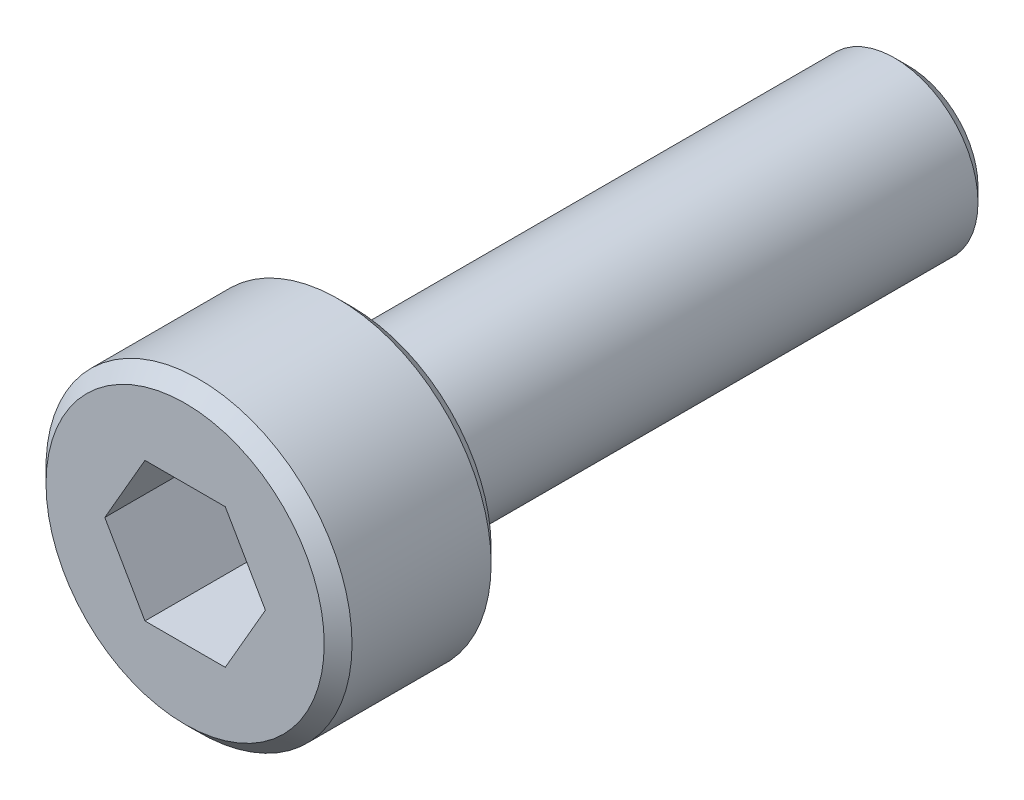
ISO-10303-21;
HEADER;
FILE_DESCRIPTION(('STEP AP214'),'2;1');
FILE_NAME('part.step','',(''),(''),'','','');
FILE_SCHEMA(('AUTOMOTIVE_DESIGN { 1 0 10303 214 1 1 1 1 }'));
ENDSEC;
DATA;
#1=APPLICATION_CONTEXT('core data for automotive mechanical design processes');
#2=APPLICATION_PROTOCOL_DEFINITION('international standard','automotive_design',2000,#1);
#3=PRODUCT_CONTEXT('',#1,'mechanical');
#4=PRODUCT('Part','Part','',(#3));
#5=PRODUCT_RELATED_PRODUCT_CATEGORY('part','',(#4));
#6=PRODUCT_DEFINITION_FORMATION('','',#4);
#7=PRODUCT_DEFINITION_CONTEXT('part definition',#1,'design');
#8=PRODUCT_DEFINITION('design','',#6,#7);
#9=PRODUCT_DEFINITION_SHAPE('','',#8);
#10=(LENGTH_UNIT() NAMED_UNIT(*) SI_UNIT(.MILLI.,.METRE.));
#11=(NAMED_UNIT(*) PLANE_ANGLE_UNIT() SI_UNIT($,.RADIAN.));
#12=(NAMED_UNIT(*) SI_UNIT($,.STERADIAN.) SOLID_ANGLE_UNIT());
#13=UNCERTAINTY_MEASURE_WITH_UNIT(LENGTH_MEASURE(1.E-05),#10,'distance_accuracy_value','');
#14=(GEOMETRIC_REPRESENTATION_CONTEXT(3) GLOBAL_UNCERTAINTY_ASSIGNED_CONTEXT((#13)) GLOBAL_UNIT_ASSIGNED_CONTEXT((#10,
#11,#12)) REPRESENTATION_CONTEXT('',''));
#15=CARTESIAN_POINT('',(0.,0.,0.));
#16=DIRECTION('',(0.,0.,1.));
#17=DIRECTION('',(1.,0.,0.));
#18=AXIS2_PLACEMENT_3D('',#15,#16,#17);
#19=CARTESIAN_POINT('',(0.,0.,10.));
#20=DIRECTION('',(0.,0.,-1.));
#21=DIRECTION('',(-1.,0.,0.));
#22=AXIS2_PLACEMENT_3D('',#19,#20,#21);
#23=CYLINDRICAL_SURFACE('',#22,1.5);
#24=CARTESIAN_POINT('',(0.,0.,0.25));
#25=DIRECTION('',(0.,0.,1.));
#26=DIRECTION('',(1.,0.,0.));
#27=AXIS2_PLACEMENT_3D('',#24,#25,#26);
#28=CIRCLE('',#27,1.5);
#29=CARTESIAN_POINT('',(1.5,0.,0.25));
#30=VERTEX_POINT('',#29);
#31=EDGE_CURVE('E189',#30,#30,#28,.T.);
#32=ORIENTED_EDGE('',*,*,#31,.T.);
#33=EDGE_LOOP('',(#32));
#34=FACE_BOUND('',#33,.T.);
#35=CARTESIAN_POINT('',(0.,0.,10.));
#36=DIRECTION('',(0.,0.,1.));
#37=DIRECTION('',(1.,0.,0.));
#38=AXIS2_PLACEMENT_3D('',#35,#36,#37);
#39=CIRCLE('',#38,1.5);
#40=CARTESIAN_POINT('',(1.5,0.,10.));
#41=VERTEX_POINT('',#40);
#42=EDGE_CURVE('E164',#41,#41,#39,.T.);
#43=ORIENTED_EDGE('',*,*,#42,.F.);
#44=EDGE_LOOP('',(#43));
#45=FACE_BOUND('',#44,.T.);
#46=ADVANCED_FACE('F47',(#34,#45),#23,.T.);
#47=CARTESIAN_POINT('',(0.,0.,0.));
#48=DIRECTION('',(0.,0.,1.));
#49=DIRECTION('',(1.,0.,0.));
#50=AXIS2_PLACEMENT_3D('',#47,#48,#49);
#51=PLANE('',#50);
#52=CARTESIAN_POINT('',(0.,0.,0.));
#53=DIRECTION('',(0.,0.,1.));
#54=DIRECTION('',(1.,0.,0.));
#55=AXIS2_PLACEMENT_3D('',#52,#53,#54);
#56=CIRCLE('',#55,1.25);
#57=CARTESIAN_POINT('',(1.25,0.,0.));
#58=VERTEX_POINT('',#57);
#59=EDGE_CURVE('E56',#58,#58,#56,.F.);
#60=ORIENTED_EDGE('',*,*,#59,.T.);
#61=EDGE_LOOP('',(#60));
#62=FACE_BOUND('',#61,.T.);
#63=ADVANCED_FACE('F197',(#62),#51,.F.);
#64=CARTESIAN_POINT('',(0.,0.,13.));
#65=DIRECTION('',(0.,0.,-1.));
#66=DIRECTION('',(-1.,0.,0.));
#67=AXIS2_PLACEMENT_3D('',#64,#65,#66);
#68=CYLINDRICAL_SURFACE('',#67,2.75);
#69=CARTESIAN_POINT('',(0.,0.,10.25));
#70=DIRECTION('',(0.,0.,1.));
#71=DIRECTION('',(1.,0.,0.));
#72=AXIS2_PLACEMENT_3D('',#69,#70,#71);
#73=CIRCLE('',#72,2.75);
#74=CARTESIAN_POINT('',(2.75,0.,10.25));
#75=VERTEX_POINT('',#74);
#76=EDGE_CURVE('E185',#75,#75,#73,.T.);
#77=ORIENTED_EDGE('',*,*,#76,.T.);
#78=EDGE_LOOP('',(#77));
#79=FACE_BOUND('',#78,.T.);
#80=CARTESIAN_POINT('',(0.,0.,12.75));
#81=DIRECTION('',(0.,0.,1.));
#82=DIRECTION('',(1.,0.,0.));
#83=AXIS2_PLACEMENT_3D('',#80,#81,#82);
#84=CIRCLE('',#83,2.75);
#85=CARTESIAN_POINT('',(2.75,0.,12.75));
#86=VERTEX_POINT('',#85);
#87=EDGE_CURVE('E179',#86,#86,#84,.F.);
#88=ORIENTED_EDGE('',*,*,#87,.T.);
#89=EDGE_LOOP('',(#88));
#90=FACE_BOUND('',#89,.T.);
#91=ADVANCED_FACE('F225',(#79,#90),#68,.T.);
#92=CARTESIAN_POINT('',(0.,0.,13.));
#93=DIRECTION('',(0.,0.,1.));
#94=DIRECTION('',(1.,0.,0.));
#95=AXIS2_PLACEMENT_3D('',#92,#93,#94);
#96=PLANE('',#95);
#97=DIRECTION('',(0.5,0.866025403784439,0.));
#98=VECTOR('',#97,1.);
#99=CARTESIAN_POINT('',(0.721687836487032,-1.25,13.));
#100=LINE('',#99,#98);
#101=CARTESIAN_POINT('',(0.721687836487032,-1.25,13.));
#102=VERTEX_POINT('',#101);
#103=CARTESIAN_POINT('',(1.44337567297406,0.,13.));
#104=VERTEX_POINT('',#103);
#105=EDGE_CURVE('E66',#102,#104,#100,.T.);
#106=ORIENTED_EDGE('',*,*,#105,.F.);
#107=DIRECTION('',(1.,0.,0.));
#108=VECTOR('',#107,1.);
#109=CARTESIAN_POINT('',(-0.721687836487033,-1.25,13.));
#110=LINE('',#109,#108);
#111=CARTESIAN_POINT('',(-0.721687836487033,-1.25,13.));
#112=VERTEX_POINT('',#111);
#113=EDGE_CURVE('E157',#112,#102,#110,.T.);
#114=ORIENTED_EDGE('',*,*,#113,.F.);
#115=DIRECTION('',(0.5,-0.866025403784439,0.));
#116=VECTOR('',#115,1.);
#117=CARTESIAN_POINT('',(-1.44337567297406,0.,13.));
#118=LINE('',#117,#116);
#119=CARTESIAN_POINT('',(-1.44337567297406,0.,13.));
#120=VERTEX_POINT('',#119);
#121=EDGE_CURVE('E156',#120,#112,#118,.T.);
#122=ORIENTED_EDGE('',*,*,#121,.F.);
#123=DIRECTION('',(-0.5,-0.866025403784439,0.));
#124=VECTOR('',#123,1.);
#125=CARTESIAN_POINT('',(-0.721687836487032,1.25,13.));
#126=LINE('',#125,#124);
#127=CARTESIAN_POINT('',(-0.721687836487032,1.25,13.));
#128=VERTEX_POINT('',#127);
#129=EDGE_CURVE('E111',#128,#120,#126,.T.);
#130=ORIENTED_EDGE('',*,*,#129,.F.);
#131=DIRECTION('',(-1.,0.,0.));
#132=VECTOR('',#131,1.);
#133=CARTESIAN_POINT('',(0.721687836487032,1.25,13.));
#134=LINE('',#133,#132);
#135=CARTESIAN_POINT('',(0.721687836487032,1.25,13.));
#136=VERTEX_POINT('',#135);
#137=EDGE_CURVE('E147',#136,#128,#134,.T.);
#138=ORIENTED_EDGE('',*,*,#137,.F.);
#139=DIRECTION('',(-0.5,0.866025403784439,0.));
#140=VECTOR('',#139,1.);
#141=CARTESIAN_POINT('',(1.44337567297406,0.,13.));
#142=LINE('',#141,#140);
#143=EDGE_CURVE('E148',#104,#136,#142,.T.);
#144=ORIENTED_EDGE('',*,*,#143,.F.);
#145=EDGE_LOOP('',(#106,#114,#122,#130,#138,#144));
#146=FACE_BOUND('',#145,.T.);
#147=CARTESIAN_POINT('',(0.,0.,13.));
#148=DIRECTION('',(0.,0.,1.));
#149=DIRECTION('',(1.,0.,0.));
#150=AXIS2_PLACEMENT_3D('',#147,#148,#149);
#151=CIRCLE('',#150,2.5);
#152=CARTESIAN_POINT('',(2.5,0.,13.));
#153=VERTEX_POINT('',#152);
#154=EDGE_CURVE('E11',#153,#153,#151,.T.);
#155=ORIENTED_EDGE('',*,*,#154,.T.);
#156=EDGE_LOOP('',(#155));
#157=FACE_BOUND('',#156,.T.);
#158=ADVANCED_FACE('F215',(#146,#157),#96,.T.);
#159=CARTESIAN_POINT('',(0.,0.,10.));
#160=DIRECTION('',(0.,0.,1.));
#161=DIRECTION('',(1.,0.,0.));
#162=AXIS2_PLACEMENT_3D('',#159,#160,#161);
#163=PLANE('',#162);
#164=CARTESIAN_POINT('',(0.,0.,10.));
#165=DIRECTION('',(0.,0.,1.));
#166=DIRECTION('',(1.,0.,0.));
#167=AXIS2_PLACEMENT_3D('',#164,#165,#166);
#168=CIRCLE('',#167,2.5);
#169=CARTESIAN_POINT('',(2.5,0.,10.));
#170=VERTEX_POINT('',#169);
#171=EDGE_CURVE('E188',#170,#170,#168,.F.);
#172=ORIENTED_EDGE('',*,*,#171,.T.);
#173=EDGE_LOOP('',(#172));
#174=FACE_BOUND('',#173,.T.);
#175=ORIENTED_EDGE('',*,*,#42,.T.);
#176=EDGE_LOOP('',(#175));
#177=FACE_BOUND('',#176,.T.);
#178=ADVANCED_FACE('F209',(#174,#177),#163,.F.);
#179=CARTESIAN_POINT('',(0.,0.,10.25));
#180=DIRECTION('',(0.,0.,1.));
#181=DIRECTION('',(1.,0.,0.));
#182=AXIS2_PLACEMENT_3D('',#179,#180,#181);
#183=CONICAL_SURFACE('',#182,2.75,0.785398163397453);
#184=ORIENTED_EDGE('',*,*,#171,.F.);
#185=EDGE_LOOP('',(#184));
#186=FACE_BOUND('',#185,.T.);
#187=ORIENTED_EDGE('',*,*,#76,.F.);
#188=EDGE_LOOP('',(#187));
#189=FACE_BOUND('',#188,.T.);
#190=ADVANCED_FACE('F205',(#186,#189),#183,.T.);
#191=CARTESIAN_POINT('',(0.,0.,0.25));
#192=DIRECTION('',(0.,0.,1.));
#193=DIRECTION('',(1.,0.,0.));
#194=AXIS2_PLACEMENT_3D('',#191,#192,#193);
#195=CONICAL_SURFACE('',#194,1.5,0.785398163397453);
#196=ORIENTED_EDGE('',*,*,#59,.F.);
#197=EDGE_LOOP('',(#196));
#198=FACE_BOUND('',#197,.T.);
#199=ORIENTED_EDGE('',*,*,#31,.F.);
#200=EDGE_LOOP('',(#199));
#201=FACE_BOUND('',#200,.T.);
#202=ADVANCED_FACE('F200',(#198,#201),#195,.T.);
#203=CARTESIAN_POINT('',(0.,0.,13.));
#204=DIRECTION('',(0.,0.,-1.));
#205=DIRECTION('',(-1.,0.,0.));
#206=AXIS2_PLACEMENT_3D('',#203,#204,#205);
#207=CONICAL_SURFACE('',#206,2.5,0.785398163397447);
#208=ORIENTED_EDGE('',*,*,#87,.F.);
#209=EDGE_LOOP('',(#208));
#210=FACE_BOUND('',#209,.T.);
#211=ORIENTED_EDGE('',*,*,#154,.F.);
#212=EDGE_LOOP('',(#211));
#213=FACE_BOUND('',#212,.T.);
#214=ADVANCED_FACE('F55',(#210,#213),#207,.T.);
#215=CARTESIAN_POINT('',(0.721687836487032,-1.25,11.));
#216=DIRECTION('',(0.866025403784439,-0.5,0.));
#217=DIRECTION('',(0.5,0.866025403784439,0.));
#218=AXIS2_PLACEMENT_3D('',#215,#216,#217);
#219=PLANE('',#218);
#220=ORIENTED_EDGE('',*,*,#105,.T.);
#221=DIRECTION('',(0.,0.,1.));
#222=VECTOR('',#221,1.);
#223=CARTESIAN_POINT('',(1.44337567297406,0.,11.));
#224=LINE('',#223,#222);
#225=CARTESIAN_POINT('',(1.44337567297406,0.,11.));
#226=VERTEX_POINT('',#225);
#227=EDGE_CURVE('E96',#226,#104,#224,.T.);
#228=ORIENTED_EDGE('',*,*,#227,.F.);
#229=DIRECTION('',(0.5,0.866025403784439,0.));
#230=VECTOR('',#229,1.);
#231=CARTESIAN_POINT('',(0.721687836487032,-1.25,11.));
#232=LINE('',#231,#230);
#233=CARTESIAN_POINT('',(0.721687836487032,-1.25,11.));
#234=VERTEX_POINT('',#233);
#235=EDGE_CURVE('E165',#234,#226,#232,.T.);
#236=ORIENTED_EDGE('',*,*,#235,.F.);
#237=DIRECTION('',(0.,0.,1.));
#238=VECTOR('',#237,1.);
#239=CARTESIAN_POINT('',(0.721687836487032,-1.25,11.));
#240=LINE('',#239,#238);
#241=EDGE_CURVE('E74',#234,#102,#240,.T.);
#242=ORIENTED_EDGE('',*,*,#241,.T.);
#243=EDGE_LOOP('',(#220,#228,#236,#242));
#244=FACE_BOUND('',#243,.T.);
#245=ADVANCED_FACE('F278',(#244),#219,.F.);
#246=CARTESIAN_POINT('',(-0.721687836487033,-1.25,11.));
#247=DIRECTION('',(0.,-1.,0.));
#248=DIRECTION('',(1.,0.,0.));
#249=AXIS2_PLACEMENT_3D('',#246,#247,#248);
#250=PLANE('',#249);
#251=ORIENTED_EDGE('',*,*,#113,.T.);
#252=ORIENTED_EDGE('',*,*,#241,.F.);
#253=DIRECTION('',(1.,0.,0.));
#254=VECTOR('',#253,1.);
#255=CARTESIAN_POINT('',(-0.721687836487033,-1.25,11.));
#256=LINE('',#255,#254);
#257=CARTESIAN_POINT('',(-0.721687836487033,-1.25,11.));
#258=VERTEX_POINT('',#257);
#259=EDGE_CURVE('E126',#258,#234,#256,.T.);
#260=ORIENTED_EDGE('',*,*,#259,.F.);
#261=DIRECTION('',(0.,0.,1.));
#262=VECTOR('',#261,1.);
#263=CARTESIAN_POINT('',(-0.721687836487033,-1.25,11.));
#264=LINE('',#263,#262);
#265=EDGE_CURVE('E117',#258,#112,#264,.T.);
#266=ORIENTED_EDGE('',*,*,#265,.T.);
#267=EDGE_LOOP('',(#251,#252,#260,#266));
#268=FACE_BOUND('',#267,.T.);
#269=ADVANCED_FACE('F289',(#268),#250,.F.);
#270=CARTESIAN_POINT('',(-1.44337567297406,0.,11.));
#271=DIRECTION('',(-0.866025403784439,-0.5,0.));
#272=DIRECTION('',(0.5,-0.866025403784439,0.));
#273=AXIS2_PLACEMENT_3D('',#270,#271,#272);
#274=PLANE('',#273);
#275=ORIENTED_EDGE('',*,*,#121,.T.);
#276=ORIENTED_EDGE('',*,*,#265,.F.);
#277=DIRECTION('',(0.5,-0.866025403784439,0.));
#278=VECTOR('',#277,1.);
#279=CARTESIAN_POINT('',(-1.44337567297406,0.,11.));
#280=LINE('',#279,#278);
#281=CARTESIAN_POINT('',(-1.44337567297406,0.,11.));
#282=VERTEX_POINT('',#281);
#283=EDGE_CURVE('E124',#282,#258,#280,.T.);
#284=ORIENTED_EDGE('',*,*,#283,.F.);
#285=DIRECTION('',(0.,0.,1.));
#286=VECTOR('',#285,1.);
#287=CARTESIAN_POINT('',(-1.44337567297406,0.,11.));
#288=LINE('',#287,#286);
#289=EDGE_CURVE('E110',#282,#120,#288,.T.);
#290=ORIENTED_EDGE('',*,*,#289,.T.);
#291=EDGE_LOOP('',(#275,#276,#284,#290));
#292=FACE_BOUND('',#291,.T.);
#293=ADVANCED_FACE('F123',(#292),#274,.F.);
#294=CARTESIAN_POINT('',(-0.721687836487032,1.25,11.));
#295=DIRECTION('',(-0.866025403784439,0.5,0.));
#296=DIRECTION('',(-0.5,-0.866025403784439,0.));
#297=AXIS2_PLACEMENT_3D('',#294,#295,#296);
#298=PLANE('',#297);
#299=ORIENTED_EDGE('',*,*,#129,.T.);
#300=ORIENTED_EDGE('',*,*,#289,.F.);
#301=DIRECTION('',(-0.5,-0.866025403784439,0.));
#302=VECTOR('',#301,1.);
#303=CARTESIAN_POINT('',(-0.721687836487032,1.25,11.));
#304=LINE('',#303,#302);
#305=CARTESIAN_POINT('',(-0.721687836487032,1.25,11.));
#306=VERTEX_POINT('',#305);
#307=EDGE_CURVE('E112',#306,#282,#304,.T.);
#308=ORIENTED_EDGE('',*,*,#307,.F.);
#309=DIRECTION('',(0.,0.,1.));
#310=VECTOR('',#309,1.);
#311=CARTESIAN_POINT('',(-0.721687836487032,1.25,11.));
#312=LINE('',#311,#310);
#313=EDGE_CURVE('E119',#306,#128,#312,.T.);
#314=ORIENTED_EDGE('',*,*,#313,.T.);
#315=EDGE_LOOP('',(#299,#300,#308,#314));
#316=FACE_BOUND('',#315,.T.);
#317=ADVANCED_FACE('F108',(#316),#298,.F.);
#318=CARTESIAN_POINT('',(0.721687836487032,1.25,11.));
#319=DIRECTION('',(0.,1.,0.));
#320=DIRECTION('',(-1.,0.,0.));
#321=AXIS2_PLACEMENT_3D('',#318,#319,#320);
#322=PLANE('',#321);
#323=ORIENTED_EDGE('',*,*,#137,.T.);
#324=ORIENTED_EDGE('',*,*,#313,.F.);
#325=DIRECTION('',(-1.,0.,0.));
#326=VECTOR('',#325,1.);
#327=CARTESIAN_POINT('',(0.721687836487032,1.25,11.));
#328=LINE('',#327,#326);
#329=CARTESIAN_POINT('',(0.721687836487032,1.25,11.));
#330=VERTEX_POINT('',#329);
#331=EDGE_CURVE('E132',#330,#306,#328,.T.);
#332=ORIENTED_EDGE('',*,*,#331,.F.);
#333=DIRECTION('',(0.,0.,1.));
#334=VECTOR('',#333,1.);
#335=CARTESIAN_POINT('',(0.721687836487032,1.25,11.));
#336=LINE('',#335,#334);
#337=EDGE_CURVE('E168',#330,#136,#336,.T.);
#338=ORIENTED_EDGE('',*,*,#337,.T.);
#339=EDGE_LOOP('',(#323,#324,#332,#338));
#340=FACE_BOUND('',#339,.T.);
#341=ADVANCED_FACE('F315',(#340),#322,.F.);
#342=CARTESIAN_POINT('',(1.44337567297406,0.,11.));
#343=DIRECTION('',(0.866025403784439,0.5,0.));
#344=DIRECTION('',(-0.5,0.866025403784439,0.));
#345=AXIS2_PLACEMENT_3D('',#342,#343,#344);
#346=PLANE('',#345);
#347=ORIENTED_EDGE('',*,*,#143,.T.);
#348=ORIENTED_EDGE('',*,*,#337,.F.);
#349=DIRECTION('',(-0.5,0.866025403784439,0.));
#350=VECTOR('',#349,1.);
#351=CARTESIAN_POINT('',(1.44337567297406,0.,11.));
#352=LINE('',#351,#350);
#353=EDGE_CURVE('E139',#226,#330,#352,.T.);
#354=ORIENTED_EDGE('',*,*,#353,.F.);
#355=ORIENTED_EDGE('',*,*,#227,.T.);
#356=EDGE_LOOP('',(#347,#348,#354,#355));
#357=FACE_BOUND('',#356,.T.);
#358=ADVANCED_FACE('F321',(#357),#346,.F.);
#359=CARTESIAN_POINT('',(0.,0.,11.));
#360=DIRECTION('',(0.,0.,1.));
#361=DIRECTION('',(1.,0.,0.));
#362=AXIS2_PLACEMENT_3D('',#359,#360,#361);
#363=PLANE('',#362);
#364=ORIENTED_EDGE('',*,*,#235,.T.);
#365=ORIENTED_EDGE('',*,*,#353,.T.);
#366=ORIENTED_EDGE('',*,*,#331,.T.);
#367=ORIENTED_EDGE('',*,*,#307,.T.);
#368=ORIENTED_EDGE('',*,*,#283,.T.);
#369=ORIENTED_EDGE('',*,*,#259,.T.);
#370=EDGE_LOOP('',(#364,#365,#366,#367,#368,#369));
#371=FACE_BOUND('',#370,.T.);
#372=ADVANCED_FACE('F133',(#371),#363,.T.);
#373=CLOSED_SHELL('',(#46,#63,#91,#158,#178,#190,#202,#214,#245,#269,#293,#317,#341,#358,#372));
#374=MANIFOLD_SOLID_BREP('B2',#373);
#375=ADVANCED_BREP_SHAPE_REPRESENTATION('',(#18,#374),#14);
#376=SHAPE_DEFINITION_REPRESENTATION(#9,#375);
ENDSEC;
END-ISO-10303-21;
